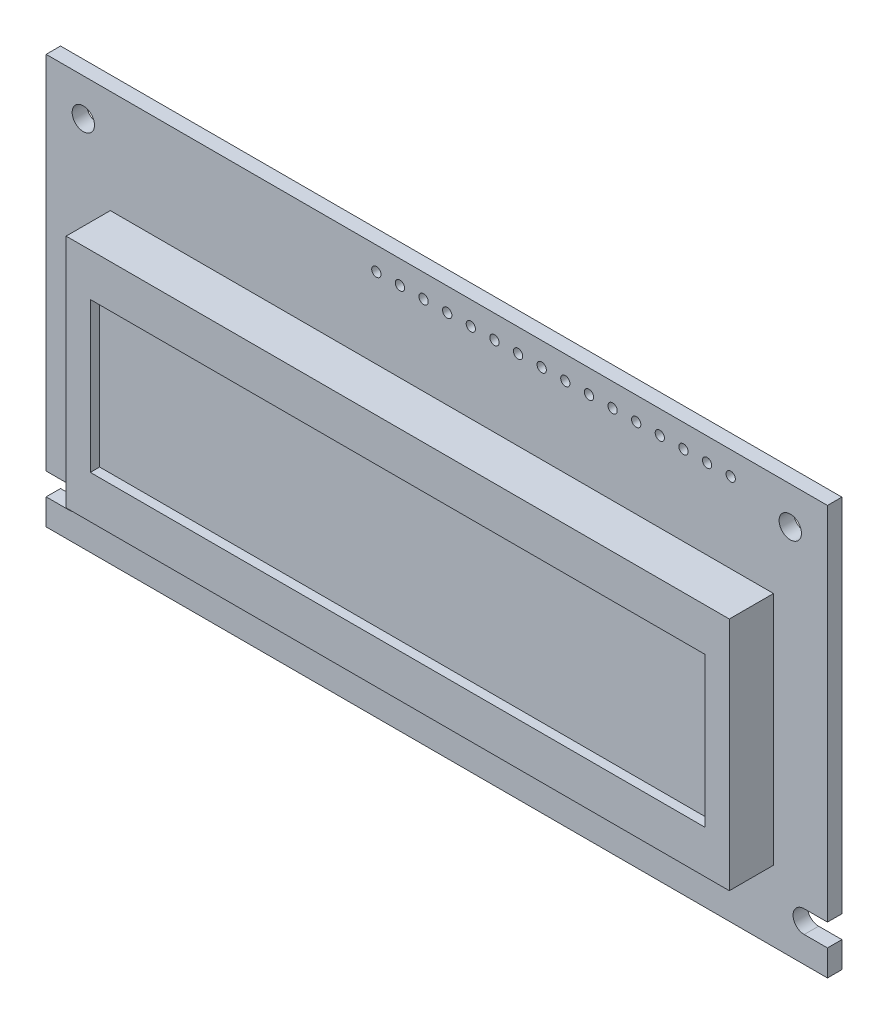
from build123d import *

# Parameters (mm, degrees)
ESQUISSE1_R             = 1.2
ESQUISSE1_R_2           = 0.5
BOSS_EXTRU_1_DEPTH      = 1.55
ESQUISSE2_W             = 71.3
ESQUISSE2_H             = 25.3
BOSS_EXTRU_2_DEPTH      = 4.75
ESQUISSE5_W             = 66.1
ESQUISSE5_H             = 16.1
ENL_V_MAT_EXTRU_2_DEPTH = 1


with BuildPart() as part:
    # Esquisse1 → Boss.-Extru.1 (new body)
    with BuildSketch(Plane.XY):
        with BuildLine():
            Line((-62.900836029, 31.990498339), (21.099163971, 31.990498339))
            Line((21.099163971, 31.990498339), (21.099163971, -6.809501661))
            Line((21.099163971, -6.809501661), (18.599163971, -6.809501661))
            ThreePointArc((18.599163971, -6.809501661), (17.399163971, -8.009501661), (18.599163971, -9.209501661))
            Line((18.599163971, -9.209501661), (21.099163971, -9.209501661))
            Line((21.099163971, -9.209501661), (21.099163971, -12.009501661))
            Line((21.099163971, -12.009501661), (-62.900836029, -12.009501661))
            Line((-62.900836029, -12.009501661), (-62.900836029, -9.209501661))
            Line((-62.900836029, -9.209501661), (-60.400836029, -9.209501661))
            ThreePointArc((-60.400836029, -9.209501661), (-59.200836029, -8.009501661), (-60.400836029, -6.809501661))
            Line((-60.400836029, -6.809501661), (-62.900836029, -6.809501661))
            Line((-62.900836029, -6.809501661), (-62.900836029, 31.990498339))
        make_face()
        with Locations(Location((-58.900836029, 27.990498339, 0), (0, 0, 180))):
            Circle(ESQUISSE1_R, mode=Mode.SUBTRACT)
        with Locations(Location((17.099163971, 27.990498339, 0), (0, 0, 180))):
            Circle(ESQUISSE1_R, mode=Mode.SUBTRACT)
        with Locations((-27.400836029, 29.490498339)):
            Circle(ESQUISSE1_R_2, mode=Mode.SUBTRACT)
        with Locations((-24.860836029, 29.490498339)):
            Circle(ESQUISSE1_R_2, mode=Mode.SUBTRACT)
        with Locations((-22.320836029, 29.490498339)):
            Circle(ESQUISSE1_R_2, mode=Mode.SUBTRACT)
        with Locations((-19.780836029, 29.490498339)):
            Circle(ESQUISSE1_R_2, mode=Mode.SUBTRACT)
        with Locations((-17.240836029, 29.490498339)):
            Circle(ESQUISSE1_R_2, mode=Mode.SUBTRACT)
        with Locations((-14.700836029, 29.490498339)):
            Circle(ESQUISSE1_R_2, mode=Mode.SUBTRACT)
        with Locations((-12.160836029, 29.490498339)):
            Circle(ESQUISSE1_R_2, mode=Mode.SUBTRACT)
        with Locations((-9.620836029, 29.490498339)):
            Circle(ESQUISSE1_R_2, mode=Mode.SUBTRACT)
        with Locations((-7.080836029, 29.490498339)):
            Circle(ESQUISSE1_R_2, mode=Mode.SUBTRACT)
        with Locations((-4.540836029, 29.490498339)):
            Circle(ESQUISSE1_R_2, mode=Mode.SUBTRACT)
        with Locations((-2.000836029, 29.490498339)):
            Circle(ESQUISSE1_R_2, mode=Mode.SUBTRACT)
        with Locations((0.539163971, 29.490498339)):
            Circle(ESQUISSE1_R_2, mode=Mode.SUBTRACT)
        with Locations((3.079163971, 29.490498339)):
            Circle(ESQUISSE1_R_2, mode=Mode.SUBTRACT)
        with Locations((5.619163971, 29.490498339)):
            Circle(ESQUISSE1_R_2, mode=Mode.SUBTRACT)
        with Locations((8.159163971, 29.490498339)):
            Circle(ESQUISSE1_R_2, mode=Mode.SUBTRACT)
        with Locations((10.699163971, 29.490498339)):
            Circle(ESQUISSE1_R_2, mode=Mode.SUBTRACT)
    extrude(amount=BOSS_EXTRU_1_DEPTH)

    # Esquisse2 → Boss.-Extru.2 (add)
    with BuildSketch(Plane.XY.offset(1.55)):
        with Locations((-20.350836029, 8.240498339)):
            Rectangle(ESQUISSE2_W, ESQUISSE2_H)
    extrude(amount=BOSS_EXTRU_2_DEPTH)

    # Esquisse5 → Enl_v. mat.-Extru.2 (cut)
    with BuildSketch(Plane.XY.offset(6.3)):
        with Locations((-20.350836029, 8.240498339)):
            Rectangle(ESQUISSE5_W, ESQUISSE5_H)
    extrude(amount=-ENL_V_MAT_EXTRU_2_DEPTH, mode=Mode.SUBTRACT)


solid = part.part
